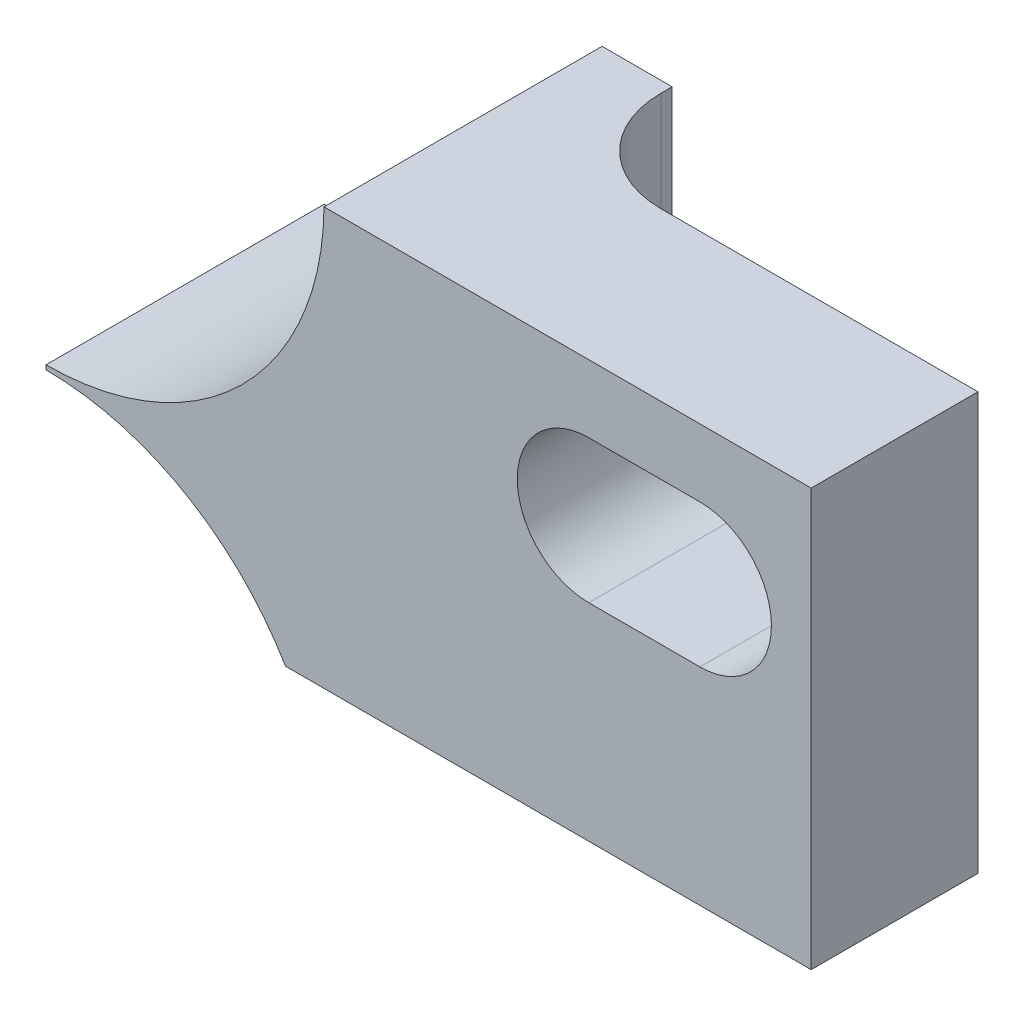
ISO-10303-21;
HEADER;
FILE_DESCRIPTION(('STEP AP214'),'2;1');
FILE_NAME('part.step','',(''),(''),'','','');
FILE_SCHEMA(('AUTOMOTIVE_DESIGN { 1 0 10303 214 1 1 1 1 }'));
ENDSEC;
DATA;
#1=APPLICATION_CONTEXT('core data for automotive mechanical design processes');
#2=APPLICATION_PROTOCOL_DEFINITION('international standard','automotive_design',2000,#1);
#3=PRODUCT_CONTEXT('',#1,'mechanical');
#4=PRODUCT('Part','Part','',(#3));
#5=PRODUCT_RELATED_PRODUCT_CATEGORY('part','',(#4));
#6=PRODUCT_DEFINITION_FORMATION('','',#4);
#7=PRODUCT_DEFINITION_CONTEXT('part definition',#1,'design');
#8=PRODUCT_DEFINITION('design','',#6,#7);
#9=PRODUCT_DEFINITION_SHAPE('','',#8);
#10=(LENGTH_UNIT() NAMED_UNIT(*) SI_UNIT(.MILLI.,.METRE.));
#11=(NAMED_UNIT(*) PLANE_ANGLE_UNIT() SI_UNIT($,.RADIAN.));
#12=(NAMED_UNIT(*) SI_UNIT($,.STERADIAN.) SOLID_ANGLE_UNIT());
#13=UNCERTAINTY_MEASURE_WITH_UNIT(LENGTH_MEASURE(1.E-05),#10,'distance_accuracy_value','');
#14=(GEOMETRIC_REPRESENTATION_CONTEXT(3) GLOBAL_UNCERTAINTY_ASSIGNED_CONTEXT((#13)) GLOBAL_UNIT_ASSIGNED_CONTEXT((#10,
#11,#12)) REPRESENTATION_CONTEXT('',''));
#15=CARTESIAN_POINT('',(0.,0.,0.));
#16=DIRECTION('',(0.,0.,1.));
#17=DIRECTION('',(1.,0.,0.));
#18=AXIS2_PLACEMENT_3D('',#15,#16,#17);
#19=CARTESIAN_POINT('',(-32.4430669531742,7.89304999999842,6.35));
#20=DIRECTION('',(0.,-1.,0.));
#21=DIRECTION('',(1.,0.,0.));
#22=AXIS2_PLACEMENT_3D('',#19,#20,#21);
#23=PLANE('',#22);
#24=DIRECTION('',(0.,0.,-1.));
#25=VECTOR('',#24,1.);
#26=CARTESIAN_POINT('',(111.76,7.89305,6.35));
#27=LINE('',#26,#25);
#28=CARTESIAN_POINT('',(111.76,7.89305,6.35));
#29=VERTEX_POINT('',#28);
#30=CARTESIAN_POINT('',(111.76,7.89305,2.54));
#31=VERTEX_POINT('',#30);
#32=EDGE_CURVE('E159',#29,#31,#27,.T.);
#33=ORIENTED_EDGE('',*,*,#32,.T.);
#34=DIRECTION('',(-1.,0.,0.));
#35=VECTOR('',#34,1.);
#36=CARTESIAN_POINT('',(-32.4430669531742,7.89304999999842,2.53999999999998));
#37=LINE('',#36,#35);
#38=CARTESIAN_POINT('',(109.22,7.89305,2.54));
#39=VERTEX_POINT('',#38);
#40=EDGE_CURVE('E56',#31,#39,#37,.T.);
#41=ORIENTED_EDGE('',*,*,#40,.T.);
#42=DIRECTION('',(0.,0.,-1.));
#43=VECTOR('',#42,1.);
#44=CARTESIAN_POINT('',(109.22,7.89305,6.35));
#45=LINE('',#44,#43);
#46=CARTESIAN_POINT('',(109.22,7.89305,6.35));
#47=VERTEX_POINT('',#46);
#48=EDGE_CURVE('E41',#47,#39,#45,.T.);
#49=ORIENTED_EDGE('',*,*,#48,.F.);
#50=DIRECTION('',(-1.,0.,0.));
#51=VECTOR('',#50,1.);
#52=CARTESIAN_POINT('',(-32.4430669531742,7.89304999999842,6.35));
#53=LINE('',#52,#51);
#54=EDGE_CURVE('E201',#29,#47,#53,.T.);
#55=ORIENTED_EDGE('',*,*,#54,.F.);
#56=EDGE_LOOP('',(#33,#41,#49,#55));
#57=FACE_BOUND('',#56,.T.);
#58=ADVANCED_FACE('F33',(#57),#23,.F.);
#59=CARTESIAN_POINT('',(109.22,9.525,6.35));
#60=DIRECTION('',(0.,0.,-1.));
#61=DIRECTION('',(-1.,0.,0.));
#62=AXIS2_PLACEMENT_3D('',#59,#60,#61);
#63=CYLINDRICAL_SURFACE('',#62,1.63195);
#64=ORIENTED_EDGE('',*,*,#48,.T.);
#65=CARTESIAN_POINT('',(109.22,9.525,2.54));
#66=DIRECTION('',(0.,0.,1.));
#67=DIRECTION('',(1.,0.,0.));
#68=AXIS2_PLACEMENT_3D('',#65,#66,#67);
#69=CIRCLE('',#68,1.63195);
#70=CARTESIAN_POINT('',(109.22,11.15695,2.54));
#71=VERTEX_POINT('',#70);
#72=EDGE_CURVE('E151',#39,#71,#69,.F.);
#73=ORIENTED_EDGE('',*,*,#72,.T.);
#74=DIRECTION('',(0.,0.,-1.));
#75=VECTOR('',#74,1.);
#76=CARTESIAN_POINT('',(109.22,11.15695,6.35));
#77=LINE('',#76,#75);
#78=CARTESIAN_POINT('',(109.22,11.15695,6.35));
#79=VERTEX_POINT('',#78);
#80=EDGE_CURVE('E166',#79,#71,#77,.T.);
#81=ORIENTED_EDGE('',*,*,#80,.F.);
#82=CARTESIAN_POINT('',(109.22,9.525,6.35));
#83=DIRECTION('',(0.,0.,-1.));
#84=DIRECTION('',(-1.,0.,0.));
#85=AXIS2_PLACEMENT_3D('',#82,#83,#84);
#86=CIRCLE('',#85,1.63195);
#87=EDGE_CURVE('E204',#47,#79,#86,.T.);
#88=ORIENTED_EDGE('',*,*,#87,.F.);
#89=EDGE_LOOP('',(#64,#73,#81,#88));
#90=FACE_BOUND('',#89,.T.);
#91=ADVANCED_FACE('F220',(#90),#63,.F.);
#92=CARTESIAN_POINT('',(-32.4430669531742,11.15695,6.35));
#93=DIRECTION('',(0.,1.,0.));
#94=DIRECTION('',(0.,0.,1.));
#95=AXIS2_PLACEMENT_3D('',#92,#93,#94);
#96=PLANE('',#95);
#97=ORIENTED_EDGE('',*,*,#80,.T.);
#98=DIRECTION('',(1.,0.,0.));
#99=VECTOR('',#98,1.);
#100=CARTESIAN_POINT('',(-32.4430669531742,11.15695,2.53999999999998));
#101=LINE('',#100,#99);
#102=CARTESIAN_POINT('',(111.76,11.15695,2.54));
#103=VERTEX_POINT('',#102);
#104=EDGE_CURVE('E225',#71,#103,#101,.T.);
#105=ORIENTED_EDGE('',*,*,#104,.T.);
#106=DIRECTION('',(0.,0.,-1.));
#107=VECTOR('',#106,1.);
#108=CARTESIAN_POINT('',(111.76,11.15695,6.35));
#109=LINE('',#108,#107);
#110=CARTESIAN_POINT('',(111.76,11.15695,6.35));
#111=VERTEX_POINT('',#110);
#112=EDGE_CURVE('E162',#111,#103,#109,.T.);
#113=ORIENTED_EDGE('',*,*,#112,.F.);
#114=DIRECTION('',(1.,0.,0.));
#115=VECTOR('',#114,1.);
#116=CARTESIAN_POINT('',(-32.4430669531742,11.15695,6.35));
#117=LINE('',#116,#115);
#118=EDGE_CURVE('E206',#79,#111,#117,.T.);
#119=ORIENTED_EDGE('',*,*,#118,.F.);
#120=EDGE_LOOP('',(#97,#105,#113,#119));
#121=FACE_BOUND('',#120,.T.);
#122=ADVANCED_FACE('F224',(#121),#96,.F.);
#123=CARTESIAN_POINT('',(96.8248,-0.0508000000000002,6.35));
#124=DIRECTION('',(0.,0.,-1.));
#125=DIRECTION('',(-1.,0.,0.));
#126=AXIS2_PLACEMENT_3D('',#123,#124,#125);
#127=CYLINDRICAL_SURFACE('',#126,6.35);
#128=CARTESIAN_POINT('',(96.8248,-0.0508000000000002,6.35));
#129=DIRECTION('',(0.,0.,-1.));
#130=DIRECTION('',(-1.,0.,0.));
#131=AXIS2_PLACEMENT_3D('',#128,#129,#130);
#132=CIRCLE('',#131,6.35);
#133=CARTESIAN_POINT('',(96.8248,6.29919999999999,6.35));
#134=VERTEX_POINT('',#133);
#135=CARTESIAN_POINT('',(102.294417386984,3.175,6.35));
#136=VERTEX_POINT('',#135);
#137=EDGE_CURVE('E140',#134,#136,#132,.T.);
#138=ORIENTED_EDGE('',*,*,#137,.F.);
#139=DIRECTION('',(0.,0.,-1.));
#140=VECTOR('',#139,1.);
#141=CARTESIAN_POINT('',(96.8248,6.2992,6.35));
#142=LINE('',#141,#140);
#143=CARTESIAN_POINT('',(96.8248,6.29919999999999,0.));
#144=VERTEX_POINT('',#143);
#145=EDGE_CURVE('E127',#134,#144,#142,.T.);
#146=ORIENTED_EDGE('',*,*,#145,.T.);
#147=CARTESIAN_POINT('',(96.8248,-0.0508000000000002,0.));
#148=DIRECTION('',(0.,0.,-1.));
#149=DIRECTION('',(-1.,0.,0.));
#150=AXIS2_PLACEMENT_3D('',#147,#148,#149);
#151=CIRCLE('',#150,6.35);
#152=CARTESIAN_POINT('',(102.294417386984,3.175,0.));
#153=VERTEX_POINT('',#152);
#154=EDGE_CURVE('E138',#144,#153,#151,.T.);
#155=ORIENTED_EDGE('',*,*,#154,.T.);
#156=DIRECTION('',(0.,0.,-1.));
#157=VECTOR('',#156,1.);
#158=CARTESIAN_POINT('',(102.294417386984,3.175,6.35));
#159=LINE('',#158,#157);
#160=EDGE_CURVE('E163',#136,#153,#159,.T.);
#161=ORIENTED_EDGE('',*,*,#160,.F.);
#162=EDGE_LOOP('',(#138,#146,#155,#161));
#163=FACE_BOUND('',#162,.T.);
#164=ADVANCED_FACE('F35',(#163),#127,.F.);
#165=CARTESIAN_POINT('',(-32.4430669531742,3.17499999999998,6.35));
#166=DIRECTION('',(0.,1.,0.));
#167=DIRECTION('',(-1.,0.,0.));
#168=AXIS2_PLACEMENT_3D('',#165,#166,#167);
#169=PLANE('',#168);
#170=CARTESIAN_POINT('',(107.061,3.17499999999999,0.253999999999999));
#171=DIRECTION('',(0.,-1.,0.));
#172=DIRECTION('',(0.,0.,-1.));
#173=AXIS2_PLACEMENT_3D('',#170,#171,#172);
#174=CIRCLE('',#173,2.28599999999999);
#175=CARTESIAN_POINT('',(104.775,3.17499999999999,0.253999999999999));
#176=VERTEX_POINT('',#175);
#177=CARTESIAN_POINT('',(107.061,3.17499999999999,2.54));
#178=VERTEX_POINT('',#177);
#179=EDGE_CURVE('E141',#176,#178,#174,.F.);
#180=ORIENTED_EDGE('',*,*,#179,.T.);
#181=DIRECTION('',(-1.,0.,0.));
#182=VECTOR('',#181,1.);
#183=CARTESIAN_POINT('',(108.297208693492,3.17499999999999,2.54));
#184=LINE('',#183,#182);
#185=CARTESIAN_POINT('',(114.3,3.17499999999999,2.54));
#186=VERTEX_POINT('',#185);
#187=EDGE_CURVE('E237',#186,#178,#184,.T.);
#188=ORIENTED_EDGE('',*,*,#187,.F.);
#189=DIRECTION('',(0.,0.,-1.));
#190=VECTOR('',#189,1.);
#191=CARTESIAN_POINT('',(114.3,3.175,6.35));
#192=LINE('',#191,#190);
#193=CARTESIAN_POINT('',(114.3,3.175,6.35));
#194=VERTEX_POINT('',#193);
#195=EDGE_CURVE('E177',#194,#186,#192,.T.);
#196=ORIENTED_EDGE('',*,*,#195,.F.);
#197=DIRECTION('',(1.,0.,0.));
#198=VECTOR('',#197,1.);
#199=CARTESIAN_POINT('',(-32.4430669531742,3.17499999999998,6.35));
#200=LINE('',#199,#198);
#201=EDGE_CURVE('E185',#136,#194,#200,.T.);
#202=ORIENTED_EDGE('',*,*,#201,.F.);
#203=ORIENTED_EDGE('',*,*,#160,.T.);
#204=DIRECTION('',(1.,0.,0.));
#205=VECTOR('',#204,1.);
#206=CARTESIAN_POINT('',(-32.4430669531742,3.17499999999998,0.));
#207=LINE('',#206,#205);
#208=CARTESIAN_POINT('',(104.775,3.175,0.));
#209=VERTEX_POINT('',#208);
#210=EDGE_CURVE('E147',#153,#209,#207,.T.);
#211=ORIENTED_EDGE('',*,*,#210,.T.);
#212=DIRECTION('',(0.,0.,-1.));
#213=VECTOR('',#212,1.);
#214=CARTESIAN_POINT('',(104.775,3.17499999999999,-7.53033118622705));
#215=LINE('',#214,#213);
#216=EDGE_CURVE('E241',#176,#209,#215,.T.);
#217=ORIENTED_EDGE('',*,*,#216,.F.);
#218=EDGE_LOOP('',(#180,#188,#196,#202,#203,#211,#217));
#219=FACE_BOUND('',#218,.T.);
#220=ADVANCED_FACE('F182',(#219),#169,.F.);
#221=CARTESIAN_POINT('',(114.3,6.35000000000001,6.35));
#222=DIRECTION('',(-1.,0.,0.));
#223=DIRECTION('',(0.,0.,1.));
#224=AXIS2_PLACEMENT_3D('',#221,#222,#223);
#225=PLANE('',#224);
#226=ORIENTED_EDGE('',*,*,#195,.T.);
#227=DIRECTION('',(0.,-1.,0.));
#228=VECTOR('',#227,1.);
#229=CARTESIAN_POINT('',(114.3,12.7,2.54));
#230=LINE('',#229,#228);
#231=CARTESIAN_POINT('',(114.3,12.7,2.54));
#232=VERTEX_POINT('',#231);
#233=EDGE_CURVE('E228',#232,#186,#230,.T.);
#234=ORIENTED_EDGE('',*,*,#233,.F.);
#235=DIRECTION('',(0.,0.,-1.));
#236=VECTOR('',#235,1.);
#237=CARTESIAN_POINT('',(114.3,12.7,6.35));
#238=LINE('',#237,#236);
#239=CARTESIAN_POINT('',(114.3,12.7,6.35));
#240=VERTEX_POINT('',#239);
#241=EDGE_CURVE('E173',#240,#232,#238,.T.);
#242=ORIENTED_EDGE('',*,*,#241,.F.);
#243=DIRECTION('',(0.,1.,0.));
#244=VECTOR('',#243,1.);
#245=CARTESIAN_POINT('',(114.3,6.35000000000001,6.35));
#246=LINE('',#245,#244);
#247=EDGE_CURVE('E189',#194,#240,#246,.T.);
#248=ORIENTED_EDGE('',*,*,#247,.F.);
#249=EDGE_LOOP('',(#226,#234,#242,#248));
#250=FACE_BOUND('',#249,.T.);
#251=ADVANCED_FACE('F271',(#250),#225,.F.);
#252=CARTESIAN_POINT('',(-32.4430669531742,12.7,6.35));
#253=DIRECTION('',(0.,1.,0.));
#254=DIRECTION('',(0.,0.,1.));
#255=AXIS2_PLACEMENT_3D('',#252,#253,#254);
#256=PLANE('',#255);
#257=DIRECTION('',(-1.,0.,0.));
#258=VECTOR('',#257,1.);
#259=CARTESIAN_POINT('',(108.297208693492,12.7,2.54));
#260=LINE('',#259,#258);
#261=CARTESIAN_POINT('',(107.061,12.7,2.54));
#262=VERTEX_POINT('',#261);
#263=EDGE_CURVE('E234',#232,#262,#260,.T.);
#264=ORIENTED_EDGE('',*,*,#263,.T.);
#265=CARTESIAN_POINT('',(107.061,12.7,0.253999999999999));
#266=DIRECTION('',(0.,-1.,0.));
#267=DIRECTION('',(0.,0.,-1.));
#268=AXIS2_PLACEMENT_3D('',#265,#266,#267);
#269=CIRCLE('',#268,2.28599999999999);
#270=CARTESIAN_POINT('',(104.775,12.7,0.253999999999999));
#271=VERTEX_POINT('',#270);
#272=EDGE_CURVE('E240',#271,#262,#269,.F.);
#273=ORIENTED_EDGE('',*,*,#272,.F.);
#274=DIRECTION('',(0.,0.,-1.));
#275=VECTOR('',#274,1.);
#276=CARTESIAN_POINT('',(104.775,12.7,-7.53033118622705));
#277=LINE('',#276,#275);
#278=CARTESIAN_POINT('',(104.775,12.7,0.));
#279=VERTEX_POINT('',#278);
#280=EDGE_CURVE('E246',#271,#279,#277,.T.);
#281=ORIENTED_EDGE('',*,*,#280,.T.);
#282=DIRECTION('',(1.,0.,0.));
#283=VECTOR('',#282,1.);
#284=CARTESIAN_POINT('',(-32.4430669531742,12.7,0.));
#285=LINE('',#284,#283);
#286=CARTESIAN_POINT('',(103.174596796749,12.7,0.));
#287=VERTEX_POINT('',#286);
#288=EDGE_CURVE('E149',#287,#279,#285,.T.);
#289=ORIENTED_EDGE('',*,*,#288,.F.);
#290=DIRECTION('',(0.,0.,-1.));
#291=VECTOR('',#290,1.);
#292=CARTESIAN_POINT('',(103.174596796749,12.7,6.35));
#293=LINE('',#292,#291);
#294=CARTESIAN_POINT('',(103.174596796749,12.7,6.35));
#295=VERTEX_POINT('',#294);
#296=EDGE_CURVE('E171',#295,#287,#293,.T.);
#297=ORIENTED_EDGE('',*,*,#296,.F.);
#298=DIRECTION('',(1.,0.,0.));
#299=VECTOR('',#298,1.);
#300=CARTESIAN_POINT('',(-32.4430669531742,12.7,6.35));
#301=LINE('',#300,#299);
#302=EDGE_CURVE('E191',#295,#240,#301,.T.);
#303=ORIENTED_EDGE('',*,*,#302,.T.);
#304=ORIENTED_EDGE('',*,*,#241,.T.);
#305=EDGE_LOOP('',(#264,#273,#281,#289,#297,#303,#304));
#306=FACE_BOUND('',#305,.T.);
#307=ADVANCED_FACE('F257',(#306),#256,.T.);
#308=CARTESIAN_POINT('',(96.8248,12.7508,6.35));
#309=DIRECTION('',(0.,0.,-1.));
#310=DIRECTION('',(-1.,0.,0.));
#311=AXIS2_PLACEMENT_3D('',#308,#309,#310);
#312=CYLINDRICAL_SURFACE('',#311,6.35);
#313=CARTESIAN_POINT('',(96.8248,12.7508,0.));
#314=DIRECTION('',(0.,0.,-1.));
#315=DIRECTION('',(-1.,0.,0.));
#316=AXIS2_PLACEMENT_3D('',#313,#314,#315);
#317=CIRCLE('',#316,6.35);
#318=CARTESIAN_POINT('',(96.8248,6.4008,0.));
#319=VERTEX_POINT('',#318);
#320=EDGE_CURVE('E157',#287,#319,#317,.T.);
#321=ORIENTED_EDGE('',*,*,#320,.T.);
#322=DIRECTION('',(0.,0.,-1.));
#323=VECTOR('',#322,1.);
#324=CARTESIAN_POINT('',(96.8248,6.4008,6.35));
#325=LINE('',#324,#323);
#326=CARTESIAN_POINT('',(96.8248,6.4008,6.35));
#327=VERTEX_POINT('',#326);
#328=EDGE_CURVE('E48',#319,#327,#325,.F.);
#329=ORIENTED_EDGE('',*,*,#328,.T.);
#330=CARTESIAN_POINT('',(96.8248,12.7508,6.35));
#331=DIRECTION('',(0.,0.,-1.));
#332=DIRECTION('',(-1.,0.,0.));
#333=AXIS2_PLACEMENT_3D('',#330,#331,#332);
#334=CIRCLE('',#333,6.35);
#335=EDGE_CURVE('E198',#295,#327,#334,.T.);
#336=ORIENTED_EDGE('',*,*,#335,.F.);
#337=ORIENTED_EDGE('',*,*,#296,.T.);
#338=EDGE_LOOP('',(#321,#329,#336,#337));
#339=FACE_BOUND('',#338,.T.);
#340=ADVANCED_FACE('F254',(#339),#312,.F.);
#341=CARTESIAN_POINT('',(111.76,9.525,6.35));
#342=DIRECTION('',(0.,0.,-1.));
#343=DIRECTION('',(-1.,0.,0.));
#344=AXIS2_PLACEMENT_3D('',#341,#342,#343);
#345=CYLINDRICAL_SURFACE('',#344,1.63195);
#346=ORIENTED_EDGE('',*,*,#112,.T.);
#347=CARTESIAN_POINT('',(111.76,9.525,2.54));
#348=DIRECTION('',(0.,0.,1.));
#349=DIRECTION('',(1.,0.,0.));
#350=AXIS2_PLACEMENT_3D('',#347,#348,#349);
#351=CIRCLE('',#350,1.63195);
#352=EDGE_CURVE('E11',#103,#31,#351,.F.);
#353=ORIENTED_EDGE('',*,*,#352,.T.);
#354=ORIENTED_EDGE('',*,*,#32,.F.);
#355=CARTESIAN_POINT('',(111.76,9.525,6.35));
#356=DIRECTION('',(0.,0.,-1.));
#357=DIRECTION('',(-1.,0.,0.));
#358=AXIS2_PLACEMENT_3D('',#355,#356,#357);
#359=CIRCLE('',#358,1.63195);
#360=EDGE_CURVE('E174',#111,#29,#359,.T.);
#361=ORIENTED_EDGE('',*,*,#360,.F.);
#362=EDGE_LOOP('',(#346,#353,#354,#361));
#363=FACE_BOUND('',#362,.T.);
#364=ADVANCED_FACE('F216',(#363),#345,.F.);
#365=CARTESIAN_POINT('',(-32.4430669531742,6.35000000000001,6.35));
#366=DIRECTION('',(0.,0.,-1.));
#367=DIRECTION('',(-1.,0.,0.));
#368=AXIS2_PLACEMENT_3D('',#365,#366,#367);
#369=PLANE('',#368);
#370=ORIENTED_EDGE('',*,*,#335,.T.);
#371=DIRECTION('',(0.,-1.,0.));
#372=VECTOR('',#371,1.);
#373=CARTESIAN_POINT('',(96.8248,25.3492,6.35));
#374=LINE('',#373,#372);
#375=EDGE_CURVE('E133',#327,#134,#374,.T.);
#376=ORIENTED_EDGE('',*,*,#375,.T.);
#377=ORIENTED_EDGE('',*,*,#137,.T.);
#378=ORIENTED_EDGE('',*,*,#201,.T.);
#379=ORIENTED_EDGE('',*,*,#247,.T.);
#380=ORIENTED_EDGE('',*,*,#302,.F.);
#381=EDGE_LOOP('',(#370,#376,#377,#378,#379,#380));
#382=FACE_BOUND('',#381,.T.);
#383=ORIENTED_EDGE('',*,*,#54,.T.);
#384=ORIENTED_EDGE('',*,*,#87,.T.);
#385=ORIENTED_EDGE('',*,*,#118,.T.);
#386=ORIENTED_EDGE('',*,*,#360,.T.);
#387=EDGE_LOOP('',(#383,#384,#385,#386));
#388=FACE_BOUND('',#387,.T.);
#389=ADVANCED_FACE('F210',(#382,#388),#369,.F.);
#390=CARTESIAN_POINT('',(-32.4430669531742,6.35000000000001,0.));
#391=DIRECTION('',(0.,0.,-1.));
#392=DIRECTION('',(-1.,0.,0.));
#393=AXIS2_PLACEMENT_3D('',#390,#391,#392);
#394=PLANE('',#393);
#395=DIRECTION('',(0.,-1.,0.));
#396=VECTOR('',#395,1.);
#397=CARTESIAN_POINT('',(96.8248,25.3492,0.));
#398=LINE('',#397,#396);
#399=EDGE_CURVE('E124',#319,#144,#398,.T.);
#400=ORIENTED_EDGE('',*,*,#399,.F.);
#401=ORIENTED_EDGE('',*,*,#320,.F.);
#402=ORIENTED_EDGE('',*,*,#288,.T.);
#403=DIRECTION('',(0.,-1.,0.));
#404=VECTOR('',#403,1.);
#405=CARTESIAN_POINT('',(104.775,12.7,0.));
#406=LINE('',#405,#404);
#407=EDGE_CURVE('E233',#279,#209,#406,.T.);
#408=ORIENTED_EDGE('',*,*,#407,.T.);
#409=ORIENTED_EDGE('',*,*,#210,.F.);
#410=ORIENTED_EDGE('',*,*,#154,.F.);
#411=EDGE_LOOP('',(#400,#401,#402,#408,#409,#410));
#412=FACE_BOUND('',#411,.T.);
#413=ADVANCED_FACE('F144',(#412),#394,.T.);
#414=CARTESIAN_POINT('',(108.297208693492,12.7,2.54));
#415=DIRECTION('',(0.,0.,1.));
#416=DIRECTION('',(1.,0.,0.));
#417=AXIS2_PLACEMENT_3D('',#414,#415,#416);
#418=PLANE('',#417);
#419=ORIENTED_EDGE('',*,*,#187,.T.);
#420=DIRECTION('',(0.,-1.,0.));
#421=VECTOR('',#420,1.);
#422=CARTESIAN_POINT('',(107.061,12.7,2.54));
#423=LINE('',#422,#421);
#424=EDGE_CURVE('E226',#262,#178,#423,.T.);
#425=ORIENTED_EDGE('',*,*,#424,.F.);
#426=ORIENTED_EDGE('',*,*,#263,.F.);
#427=ORIENTED_EDGE('',*,*,#233,.T.);
#428=EDGE_LOOP('',(#419,#425,#426,#427));
#429=FACE_BOUND('',#428,.T.);
#430=ORIENTED_EDGE('',*,*,#352,.F.);
#431=ORIENTED_EDGE('',*,*,#104,.F.);
#432=ORIENTED_EDGE('',*,*,#72,.F.);
#433=ORIENTED_EDGE('',*,*,#40,.F.);
#434=EDGE_LOOP('',(#430,#431,#432,#433));
#435=FACE_BOUND('',#434,.T.);
#436=ADVANCED_FACE('F267',(#429,#435),#418,.F.);
#437=CARTESIAN_POINT('',(107.061,12.7,0.253999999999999));
#438=DIRECTION('',(0.,-1.,0.));
#439=DIRECTION('',(0.,0.,-1.));
#440=AXIS2_PLACEMENT_3D('',#437,#438,#439);
#441=CYLINDRICAL_SURFACE('',#440,2.28599999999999);
#442=ORIENTED_EDGE('',*,*,#179,.F.);
#443=DIRECTION('',(0.,-1.,0.));
#444=VECTOR('',#443,1.);
#445=CARTESIAN_POINT('',(104.775,12.7,0.253999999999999));
#446=LINE('',#445,#444);
#447=EDGE_CURVE('E231',#271,#176,#446,.T.);
#448=ORIENTED_EDGE('',*,*,#447,.F.);
#449=ORIENTED_EDGE('',*,*,#272,.T.);
#450=ORIENTED_EDGE('',*,*,#424,.T.);
#451=EDGE_LOOP('',(#442,#448,#449,#450));
#452=FACE_BOUND('',#451,.T.);
#453=ADVANCED_FACE('F264',(#452),#441,.F.);
#454=CARTESIAN_POINT('',(104.775,12.7,-7.53033118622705));
#455=DIRECTION('',(-1.,0.,0.));
#456=DIRECTION('',(0.,0.,1.));
#457=AXIS2_PLACEMENT_3D('',#454,#455,#456);
#458=PLANE('',#457);
#459=ORIENTED_EDGE('',*,*,#216,.T.);
#460=ORIENTED_EDGE('',*,*,#407,.F.);
#461=ORIENTED_EDGE('',*,*,#280,.F.);
#462=ORIENTED_EDGE('',*,*,#447,.T.);
#463=EDGE_LOOP('',(#459,#460,#461,#462));
#464=FACE_BOUND('',#463,.T.);
#465=ADVANCED_FACE('F261',(#464),#458,.F.);
#466=CARTESIAN_POINT('',(96.8248,25.3492,6.35));
#467=DIRECTION('',(1.,0.,0.));
#468=DIRECTION('',(0.,1.,0.));
#469=AXIS2_PLACEMENT_3D('',#466,#467,#468);
#470=PLANE('',#469);
#471=ORIENTED_EDGE('',*,*,#375,.F.);
#472=ORIENTED_EDGE('',*,*,#328,.F.);
#473=ORIENTED_EDGE('',*,*,#399,.T.);
#474=ORIENTED_EDGE('',*,*,#145,.F.);
#475=EDGE_LOOP('',(#471,#472,#473,#474));
#476=FACE_BOUND('',#475,.T.);
#477=ADVANCED_FACE('F126',(#476),#470,.F.);
#478=CLOSED_SHELL('',(#58,#91,#122,#164,#220,#251,#307,#340,#364,#389,#413,#436,#453,#465,#477));
#479=MANIFOLD_SOLID_BREP('B2',#478);
#480=ADVANCED_BREP_SHAPE_REPRESENTATION('',(#18,#479),#14);
#481=SHAPE_DEFINITION_REPRESENTATION(#9,#480);
ENDSEC;
END-ISO-10303-21;
